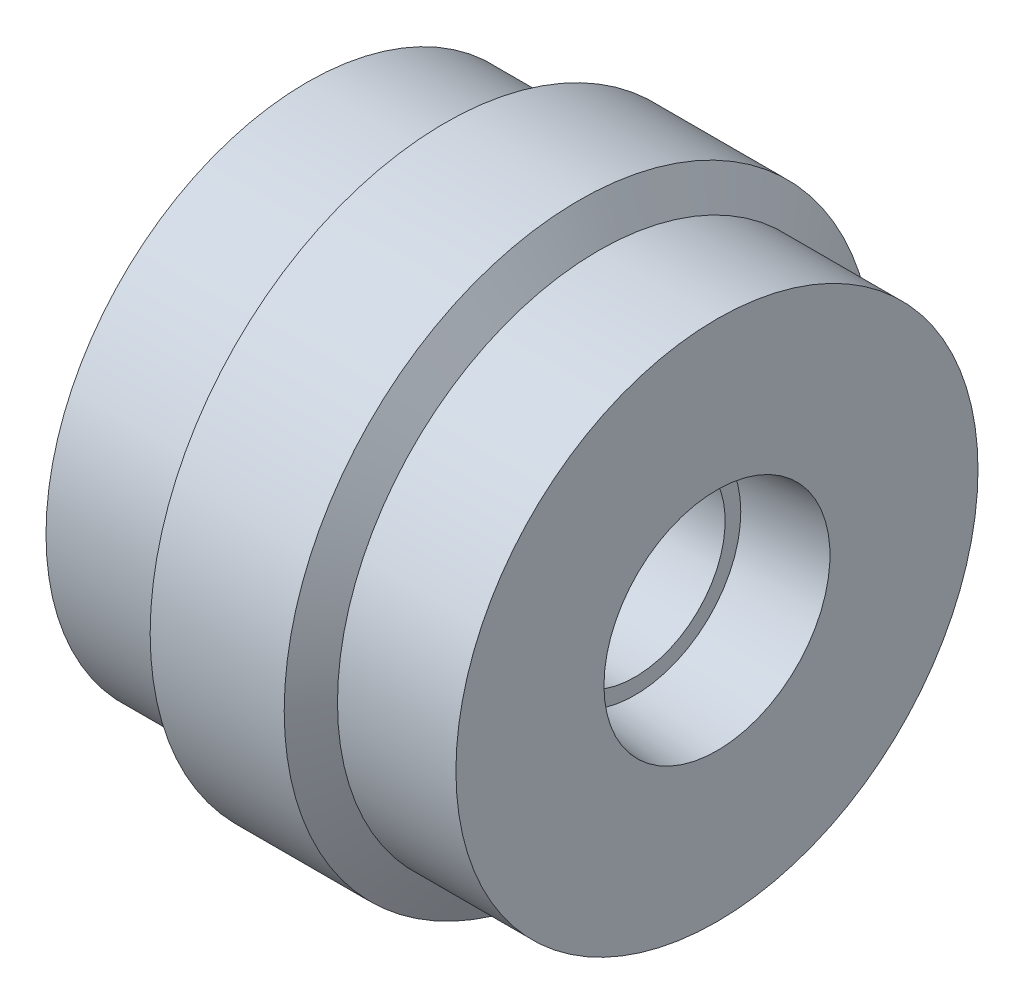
ISO-10303-21;
HEADER;
FILE_DESCRIPTION(('STEP AP214'),'2;1');
FILE_NAME('part.step','',(''),(''),'','','');
FILE_SCHEMA(('AUTOMOTIVE_DESIGN { 1 0 10303 214 1 1 1 1 }'));
ENDSEC;
DATA;
#1=APPLICATION_CONTEXT('core data for automotive mechanical design processes');
#2=APPLICATION_PROTOCOL_DEFINITION('international standard','automotive_design',2000,#1);
#3=PRODUCT_CONTEXT('',#1,'mechanical');
#4=PRODUCT('Part','Part','',(#3));
#5=PRODUCT_RELATED_PRODUCT_CATEGORY('part','',(#4));
#6=PRODUCT_DEFINITION_FORMATION('','',#4);
#7=PRODUCT_DEFINITION_CONTEXT('part definition',#1,'design');
#8=PRODUCT_DEFINITION('design','',#6,#7);
#9=PRODUCT_DEFINITION_SHAPE('','',#8);
#10=(LENGTH_UNIT() NAMED_UNIT(*) SI_UNIT(.MILLI.,.METRE.));
#11=(NAMED_UNIT(*) PLANE_ANGLE_UNIT() SI_UNIT($,.RADIAN.));
#12=(NAMED_UNIT(*) SI_UNIT($,.STERADIAN.) SOLID_ANGLE_UNIT());
#13=UNCERTAINTY_MEASURE_WITH_UNIT(LENGTH_MEASURE(1.E-05),#10,'distance_accuracy_value','');
#14=(GEOMETRIC_REPRESENTATION_CONTEXT(3) GLOBAL_UNCERTAINTY_ASSIGNED_CONTEXT((#13)) GLOBAL_UNIT_ASSIGNED_CONTEXT((#10,
#11,#12)) REPRESENTATION_CONTEXT('',''));
#15=CARTESIAN_POINT('',(0.,0.,0.));
#16=DIRECTION('',(0.,0.,1.));
#17=DIRECTION('',(1.,0.,0.));
#18=AXIS2_PLACEMENT_3D('',#15,#16,#17);
#19=CARTESIAN_POINT('',(0.,6.8834,0.));
#20=DIRECTION('',(1.,0.,0.));
#21=DIRECTION('',(0.,0.,-1.));
#22=AXIS2_PLACEMENT_3D('',#19,#20,#21);
#23=PLANE('',#22);
#24=CARTESIAN_POINT('',(0.,0.,0.));
#25=DIRECTION('',(-1.,0.,0.));
#26=DIRECTION('',(0.,0.,1.));
#27=AXIS2_PLACEMENT_3D('',#24,#25,#26);
#28=CIRCLE('',#27,6.8834);
#29=CARTESIAN_POINT('',(0.,0.,6.8834));
#30=VERTEX_POINT('',#29);
#31=EDGE_CURVE('E71',#30,#30,#28,.T.);
#32=ORIENTED_EDGE('',*,*,#31,.F.);
#33=EDGE_LOOP('',(#32));
#34=FACE_BOUND('',#33,.T.);
#35=CARTESIAN_POINT('',(0.,0.,0.));
#36=DIRECTION('',(-1.,0.,0.));
#37=DIRECTION('',(0.,0.,1.));
#38=AXIS2_PLACEMENT_3D('',#35,#36,#37);
#39=CIRCLE('',#38,15.9004);
#40=CARTESIAN_POINT('',(0.,0.,15.9004));
#41=VERTEX_POINT('',#40);
#42=EDGE_CURVE('E10',#41,#41,#39,.T.);
#43=ORIENTED_EDGE('',*,*,#42,.T.);
#44=EDGE_LOOP('',(#43));
#45=FACE_BOUND('',#44,.T.);
#46=ADVANCED_FACE('F31',(#34,#45),#23,.F.);
#47=CARTESIAN_POINT('',(0.,0.,0.));
#48=DIRECTION('',(-1.,0.,0.));
#49=DIRECTION('',(0.,0.,1.));
#50=AXIS2_PLACEMENT_3D('',#47,#48,#49);
#51=CYLINDRICAL_SURFACE('',#50,15.9004);
#52=ORIENTED_EDGE('',*,*,#42,.F.);
#53=EDGE_LOOP('',(#52));
#54=FACE_BOUND('',#53,.T.);
#55=CARTESIAN_POINT('',(7.2136,0.,0.));
#56=DIRECTION('',(-1.,0.,0.));
#57=DIRECTION('',(0.,0.,1.));
#58=AXIS2_PLACEMENT_3D('',#55,#56,#57);
#59=CIRCLE('',#58,15.9004);
#60=CARTESIAN_POINT('',(7.2136,0.,15.9004));
#61=VERTEX_POINT('',#60);
#62=EDGE_CURVE('E37',#61,#61,#59,.T.);
#63=ORIENTED_EDGE('',*,*,#62,.T.);
#64=EDGE_LOOP('',(#63));
#65=FACE_BOUND('',#64,.T.);
#66=ADVANCED_FACE('F78',(#54,#65),#51,.T.);
#67=CARTESIAN_POINT('',(8.40144044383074,0.,0.));
#68=DIRECTION('',(1.,0.,0.));
#69=DIRECTION('',(0.,0.,-1.));
#70=AXIS2_PLACEMENT_3D('',#67,#68,#69);
#71=CONICAL_SURFACE('',#70,17.9578,1.0471975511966);
#72=ORIENTED_EDGE('',*,*,#62,.F.);
#73=EDGE_LOOP('',(#72));
#74=FACE_BOUND('',#73,.T.);
#75=CARTESIAN_POINT('',(8.40144044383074,0.,0.));
#76=DIRECTION('',(-1.,0.,0.));
#77=DIRECTION('',(0.,0.,1.));
#78=AXIS2_PLACEMENT_3D('',#75,#76,#77);
#79=CIRCLE('',#78,17.9578);
#80=CARTESIAN_POINT('',(8.40144044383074,0.,17.9578));
#81=VERTEX_POINT('',#80);
#82=EDGE_CURVE('E41',#81,#81,#79,.T.);
#83=ORIENTED_EDGE('',*,*,#82,.T.);
#84=EDGE_LOOP('',(#83));
#85=FACE_BOUND('',#84,.T.);
#86=ADVANCED_FACE('F82',(#74,#85),#71,.T.);
#87=CARTESIAN_POINT('',(0.,0.,0.));
#88=DIRECTION('',(-1.,0.,0.));
#89=DIRECTION('',(0.,0.,1.));
#90=AXIS2_PLACEMENT_3D('',#87,#88,#89);
#91=CYLINDRICAL_SURFACE('',#90,17.9578);
#92=ORIENTED_EDGE('',*,*,#82,.F.);
#93=EDGE_LOOP('',(#92));
#94=FACE_BOUND('',#93,.T.);
#95=CARTESIAN_POINT('',(16.5667595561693,0.,0.));
#96=DIRECTION('',(-1.,0.,0.));
#97=DIRECTION('',(0.,0.,1.));
#98=AXIS2_PLACEMENT_3D('',#95,#96,#97);
#99=CIRCLE('',#98,17.9578);
#100=CARTESIAN_POINT('',(16.5667595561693,0.,17.9578));
#101=VERTEX_POINT('',#100);
#102=EDGE_CURVE('E45',#101,#101,#99,.T.);
#103=ORIENTED_EDGE('',*,*,#102,.T.);
#104=EDGE_LOOP('',(#103));
#105=FACE_BOUND('',#104,.T.);
#106=ADVANCED_FACE('F87',(#94,#105),#91,.T.);
#107=CARTESIAN_POINT('',(17.7546,0.,0.));
#108=DIRECTION('',(-1.,0.,0.));
#109=DIRECTION('',(0.,0.,1.));
#110=AXIS2_PLACEMENT_3D('',#107,#108,#109);
#111=CONICAL_SURFACE('',#110,15.9004,1.0471975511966);
#112=ORIENTED_EDGE('',*,*,#102,.F.);
#113=EDGE_LOOP('',(#112));
#114=FACE_BOUND('',#113,.T.);
#115=CARTESIAN_POINT('',(17.7546,0.,0.));
#116=DIRECTION('',(-1.,0.,0.));
#117=DIRECTION('',(0.,0.,1.));
#118=AXIS2_PLACEMENT_3D('',#115,#116,#117);
#119=CIRCLE('',#118,15.9004);
#120=CARTESIAN_POINT('',(17.7546,0.,15.9004));
#121=VERTEX_POINT('',#120);
#122=EDGE_CURVE('E50',#121,#121,#119,.T.);
#123=ORIENTED_EDGE('',*,*,#122,.T.);
#124=EDGE_LOOP('',(#123));
#125=FACE_BOUND('',#124,.T.);
#126=ADVANCED_FACE('F93',(#114,#125),#111,.T.);
#127=CARTESIAN_POINT('',(0.,0.,0.));
#128=DIRECTION('',(-1.,0.,0.));
#129=DIRECTION('',(0.,0.,1.));
#130=AXIS2_PLACEMENT_3D('',#127,#128,#129);
#131=CYLINDRICAL_SURFACE('',#130,15.9004);
#132=ORIENTED_EDGE('',*,*,#122,.F.);
#133=EDGE_LOOP('',(#132));
#134=FACE_BOUND('',#133,.T.);
#135=CARTESIAN_POINT('',(24.9682,0.,0.));
#136=DIRECTION('',(-1.,0.,0.));
#137=DIRECTION('',(0.,0.,1.));
#138=AXIS2_PLACEMENT_3D('',#135,#136,#137);
#139=CIRCLE('',#138,15.9004);
#140=CARTESIAN_POINT('',(24.9682,0.,15.9004));
#141=VERTEX_POINT('',#140);
#142=EDGE_CURVE('E53',#141,#141,#139,.T.);
#143=ORIENTED_EDGE('',*,*,#142,.T.);
#144=EDGE_LOOP('',(#143));
#145=FACE_BOUND('',#144,.T.);
#146=ADVANCED_FACE('F97',(#134,#145),#131,.T.);
#147=CARTESIAN_POINT('',(24.9682,15.9004,0.));
#148=DIRECTION('',(-1.,0.,0.));
#149=DIRECTION('',(0.,0.,1.));
#150=AXIS2_PLACEMENT_3D('',#147,#148,#149);
#151=PLANE('',#150);
#152=ORIENTED_EDGE('',*,*,#142,.F.);
#153=EDGE_LOOP('',(#152));
#154=FACE_BOUND('',#153,.T.);
#155=CARTESIAN_POINT('',(24.9682,0.,0.));
#156=DIRECTION('',(-1.,0.,0.));
#157=DIRECTION('',(0.,0.,1.));
#158=AXIS2_PLACEMENT_3D('',#155,#156,#157);
#159=CIRCLE('',#158,6.8834);
#160=CARTESIAN_POINT('',(24.9682,0.,6.8834));
#161=VERTEX_POINT('',#160);
#162=EDGE_CURVE('E56',#161,#161,#159,.T.);
#163=ORIENTED_EDGE('',*,*,#162,.T.);
#164=EDGE_LOOP('',(#163));
#165=FACE_BOUND('',#164,.T.);
#166=ADVANCED_FACE('F101',(#154,#165),#151,.F.);
#167=CARTESIAN_POINT('',(19.9682,0.,0.));
#168=DIRECTION('',(1.,0.,0.));
#169=DIRECTION('',(0.,0.,-1.));
#170=AXIS2_PLACEMENT_3D('',#167,#168,#169);
#171=CONICAL_SURFACE('',#170,6.4516,0.0861462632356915);
#172=ORIENTED_EDGE('',*,*,#162,.F.);
#173=EDGE_LOOP('',(#172));
#174=FACE_BOUND('',#173,.T.);
#175=CARTESIAN_POINT('',(19.9682,0.,0.));
#176=DIRECTION('',(-1.,0.,0.));
#177=DIRECTION('',(0.,0.,1.));
#178=AXIS2_PLACEMENT_3D('',#175,#176,#177);
#179=CIRCLE('',#178,6.4516);
#180=CARTESIAN_POINT('',(19.9682,0.,6.4516));
#181=VERTEX_POINT('',#180);
#182=EDGE_CURVE('E59',#181,#181,#179,.T.);
#183=ORIENTED_EDGE('',*,*,#182,.T.);
#184=EDGE_LOOP('',(#183));
#185=FACE_BOUND('',#184,.T.);
#186=ADVANCED_FACE('F105',(#174,#185),#171,.F.);
#187=CARTESIAN_POINT('',(19.9682,6.4516,0.));
#188=DIRECTION('',(-1.,0.,0.));
#189=DIRECTION('',(0.,0.,1.));
#190=AXIS2_PLACEMENT_3D('',#187,#188,#189);
#191=PLANE('',#190);
#192=ORIENTED_EDGE('',*,*,#182,.F.);
#193=EDGE_LOOP('',(#192));
#194=FACE_BOUND('',#193,.T.);
#195=CARTESIAN_POINT('',(19.9682,0.,0.));
#196=DIRECTION('',(-1.,0.,0.));
#197=DIRECTION('',(0.,0.,1.));
#198=AXIS2_PLACEMENT_3D('',#195,#196,#197);
#199=CIRCLE('',#198,5.5);
#200=CARTESIAN_POINT('',(19.9682,0.,5.5));
#201=VERTEX_POINT('',#200);
#202=EDGE_CURVE('E62',#201,#201,#199,.T.);
#203=ORIENTED_EDGE('',*,*,#202,.T.);
#204=EDGE_LOOP('',(#203));
#205=FACE_BOUND('',#204,.T.);
#206=ADVANCED_FACE('F109',(#194,#205),#191,.F.);
#207=CARTESIAN_POINT('',(0.,0.,0.));
#208=DIRECTION('',(-1.,0.,0.));
#209=DIRECTION('',(0.,0.,1.));
#210=AXIS2_PLACEMENT_3D('',#207,#208,#209);
#211=CYLINDRICAL_SURFACE('',#210,5.5);
#212=ORIENTED_EDGE('',*,*,#202,.F.);
#213=EDGE_LOOP('',(#212));
#214=FACE_BOUND('',#213,.T.);
#215=CARTESIAN_POINT('',(5.,0.,0.));
#216=DIRECTION('',(-1.,0.,0.));
#217=DIRECTION('',(0.,0.,1.));
#218=AXIS2_PLACEMENT_3D('',#215,#216,#217);
#219=CIRCLE('',#218,5.5);
#220=CARTESIAN_POINT('',(5.,0.,5.5));
#221=VERTEX_POINT('',#220);
#222=EDGE_CURVE('E65',#221,#221,#219,.T.);
#223=ORIENTED_EDGE('',*,*,#222,.T.);
#224=EDGE_LOOP('',(#223));
#225=FACE_BOUND('',#224,.T.);
#226=ADVANCED_FACE('F113',(#214,#225),#211,.F.);
#227=CARTESIAN_POINT('',(5.,5.5,0.));
#228=DIRECTION('',(1.,0.,0.));
#229=DIRECTION('',(0.,0.,-1.));
#230=AXIS2_PLACEMENT_3D('',#227,#228,#229);
#231=PLANE('',#230);
#232=ORIENTED_EDGE('',*,*,#222,.F.);
#233=EDGE_LOOP('',(#232));
#234=FACE_BOUND('',#233,.T.);
#235=CARTESIAN_POINT('',(5.,0.,0.));
#236=DIRECTION('',(-1.,0.,0.));
#237=DIRECTION('',(0.,0.,1.));
#238=AXIS2_PLACEMENT_3D('',#235,#236,#237);
#239=CIRCLE('',#238,6.4516);
#240=CARTESIAN_POINT('',(5.,0.,6.4516));
#241=VERTEX_POINT('',#240);
#242=EDGE_CURVE('E68',#241,#241,#239,.T.);
#243=ORIENTED_EDGE('',*,*,#242,.T.);
#244=EDGE_LOOP('',(#243));
#245=FACE_BOUND('',#244,.T.);
#246=ADVANCED_FACE('F117',(#234,#245),#231,.F.);
#247=CARTESIAN_POINT('',(0.,0.,0.));
#248=DIRECTION('',(-1.,0.,0.));
#249=DIRECTION('',(0.,0.,1.));
#250=AXIS2_PLACEMENT_3D('',#247,#248,#249);
#251=CONICAL_SURFACE('',#250,6.8834,0.0861462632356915);
#252=ORIENTED_EDGE('',*,*,#242,.F.);
#253=EDGE_LOOP('',(#252));
#254=FACE_BOUND('',#253,.T.);
#255=ORIENTED_EDGE('',*,*,#31,.T.);
#256=EDGE_LOOP('',(#255));
#257=FACE_BOUND('',#256,.T.);
#258=ADVANCED_FACE('F75',(#254,#257),#251,.F.);
#259=CLOSED_SHELL('',(#46,#66,#86,#106,#126,#146,#166,#186,#206,#226,#246,#258));
#260=MANIFOLD_SOLID_BREP('B2',#259);
#261=ADVANCED_BREP_SHAPE_REPRESENTATION('',(#18,#260),#14);
#262=SHAPE_DEFINITION_REPRESENTATION(#9,#261);
ENDSEC;
END-ISO-10303-21;
